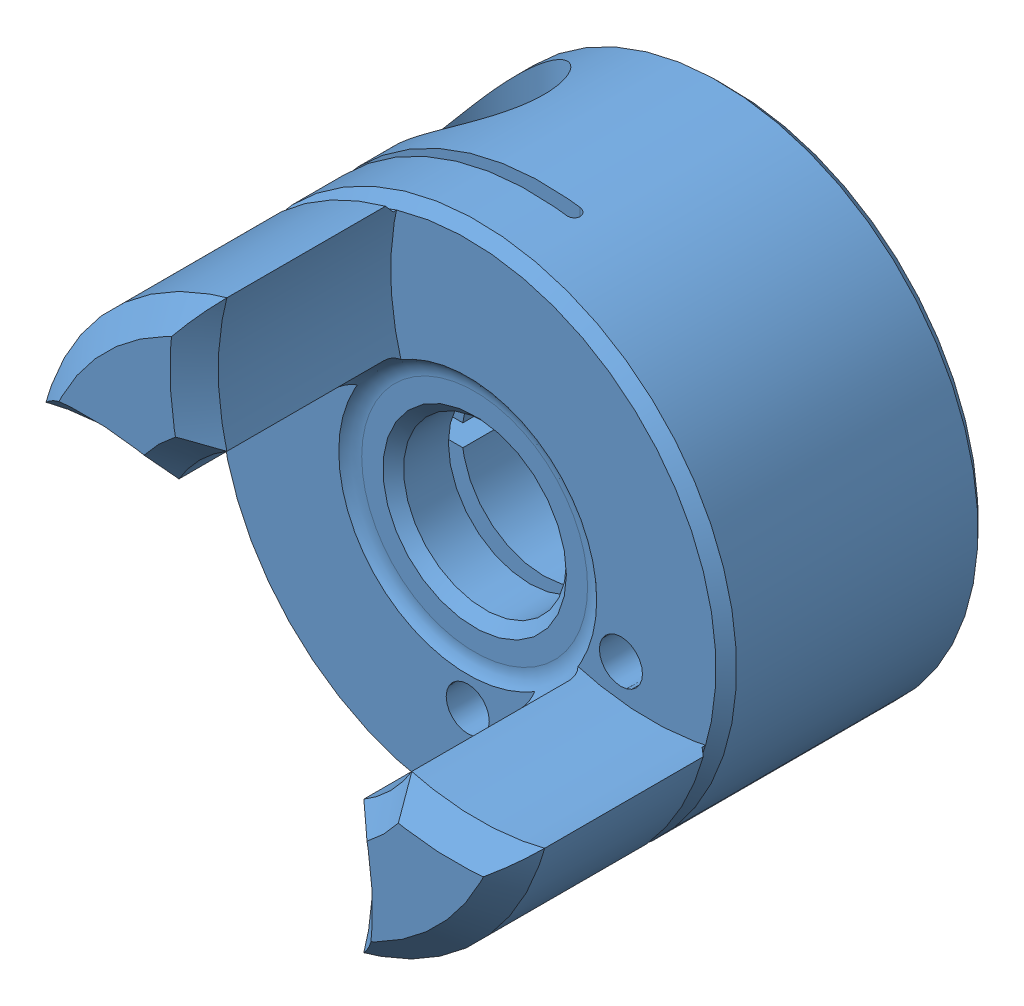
SolidWorks assembly MJC19-6-A.SLDASM, configuration Default (file format 13000). Lengths in mm.
Overall size (19.05 19.05 16.89).
2 component instances, 2 part files, 0 mates.
Components (placement in the parent):
- MJC19-6-A-1: MJC19-6-A.SLDPRT [Default] at origin size (19.05 19.05 16.89)
- MJC19-6-A_Vis-1: MJC19-6-A_Vis.SLDPRT [Default] at origin size (4.5 10.5 4.5)
